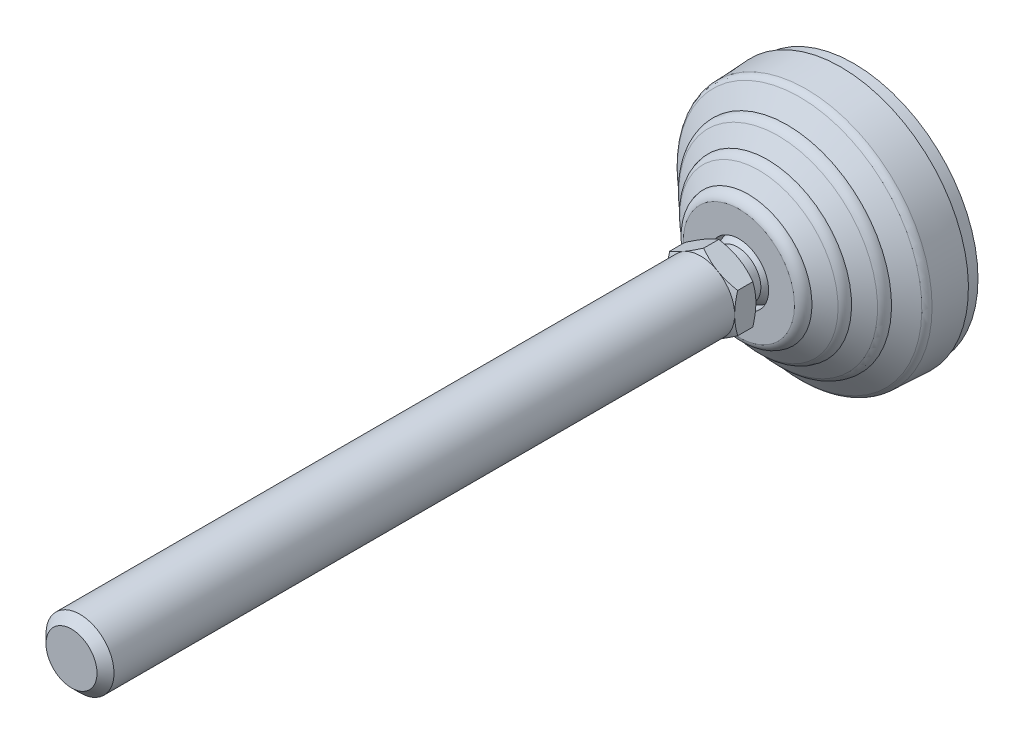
ISO-10303-21;
HEADER;
FILE_DESCRIPTION(('STEP AP214'),'2;1');
FILE_NAME('part.step','',(''),(''),'','','');
FILE_SCHEMA(('AUTOMOTIVE_DESIGN { 1 0 10303 214 1 1 1 1 }'));
ENDSEC;
DATA;
#1=APPLICATION_CONTEXT('core data for automotive mechanical design processes');
#2=APPLICATION_PROTOCOL_DEFINITION('international standard','automotive_design',2000,#1);
#3=PRODUCT_CONTEXT('',#1,'mechanical');
#4=PRODUCT('Part','Part','',(#3));
#5=PRODUCT_RELATED_PRODUCT_CATEGORY('part','',(#4));
#6=PRODUCT_DEFINITION_FORMATION('','',#4);
#7=PRODUCT_DEFINITION_CONTEXT('part definition',#1,'design');
#8=PRODUCT_DEFINITION('design','',#6,#7);
#9=PRODUCT_DEFINITION_SHAPE('','',#8);
#10=(LENGTH_UNIT() NAMED_UNIT(*) SI_UNIT(.MILLI.,.METRE.));
#11=(NAMED_UNIT(*) PLANE_ANGLE_UNIT() SI_UNIT($,.RADIAN.));
#12=(NAMED_UNIT(*) SI_UNIT($,.STERADIAN.) SOLID_ANGLE_UNIT());
#13=UNCERTAINTY_MEASURE_WITH_UNIT(LENGTH_MEASURE(1.E-05),#10,'distance_accuracy_value','');
#14=(GEOMETRIC_REPRESENTATION_CONTEXT(3) GLOBAL_UNCERTAINTY_ASSIGNED_CONTEXT((#13)) GLOBAL_UNIT_ASSIGNED_CONTEXT((#10,
#11,#12)) REPRESENTATION_CONTEXT('',''));
#15=CARTESIAN_POINT('',(0.,0.,0.));
#16=DIRECTION('',(0.,0.,1.));
#17=DIRECTION('',(1.,0.,0.));
#18=AXIS2_PLACEMENT_3D('',#15,#16,#17);
#19=CARTESIAN_POINT('',(0.,0.,35.2753734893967));
#20=DIRECTION('',(0.,0.,-1.));
#21=DIRECTION('',(0.,1.,0.));
#22=AXIS2_PLACEMENT_3D('',#19,#20,#21);
#23=CONICAL_SURFACE('',#22,9.2450899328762,1.0471975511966);
#24=CARTESIAN_POINT('',(0.,0.,36.));
#25=DIRECTION('',(0.,0.,-1.));
#26=DIRECTION('',(0.,1.,0.));
#27=AXIS2_PLACEMENT_3D('',#24,#25,#26);
#28=CIRCLE('',#27,7.99);
#29=CARTESIAN_POINT('',(0.,7.99,36.));
#30=VERTEX_POINT('',#29);
#31=EDGE_CURVE('E124',#30,#30,#28,.F.);
#32=ORIENTED_EDGE('',*,*,#31,.F.);
#33=EDGE_LOOP('',(#32));
#34=FACE_BOUND('',#33,.T.);
#35=CARTESIAN_POINT('',(-4.19327850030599E-08,-9.23760428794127,35.2796952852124));
#36=CARTESIAN_POINT('',(0.175847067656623,-9.13607893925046,35.3382996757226));
#37=CARTESIAN_POINT('',(0.352349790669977,-9.03417505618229,35.3942441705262));
#38=CARTESIAN_POINT('',(0.706788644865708,-8.82953969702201,35.5000807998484));
#39=CARTESIAN_POINT('',(0.884725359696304,-8.72680788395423,35.5499703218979));
#40=CARTESIAN_POINT('',(1.42138431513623,-8.41696768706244,35.6895770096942));
#41=CARTESIAN_POINT('',(1.78222493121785,-8.20863626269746,35.7689823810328));
#42=CARTESIAN_POINT('',(2.32221590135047,-7.896872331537,35.862092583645));
#43=CARTESIAN_POINT('',(2.49975318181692,-7.79437113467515,35.8886165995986));
#44=CARTESIAN_POINT('',(2.85563052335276,-7.58890525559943,35.9330919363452));
#45=CARTESIAN_POINT('',(3.03397051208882,-7.48594061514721,35.9510440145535));
#46=CARTESIAN_POINT('',(3.3909574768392,-7.27983409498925,35.9779205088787));
#47=CARTESIAN_POINT('',(3.56960387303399,-7.17669255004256,35.9868551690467));
#48=CARTESIAN_POINT('',(3.92706158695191,-6.97031424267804,35.9955052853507));
#49=CARTESIAN_POINT('',(4.10587289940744,-6.86707748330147,35.995221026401));
#50=CARTESIAN_POINT('',(4.44015430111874,-6.67408002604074,35.9860752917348));
#51=CARTESIAN_POINT('',(4.59564800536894,-6.58430569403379,35.9783294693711));
#52=CARTESIAN_POINT('',(4.90627121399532,-6.4049673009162,35.956016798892));
#53=CARTESIAN_POINT('',(5.06140069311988,-6.31540325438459,35.9414494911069));
#54=CARTESIAN_POINT('',(5.52618852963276,-6.04705787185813,35.8878596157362));
#55=CARTESIAN_POINT('',(5.83502420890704,-5.86875150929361,35.8389557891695));
#56=CARTESIAN_POINT('',(6.455971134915,-5.51024763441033,35.7166979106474));
#57=CARTESIAN_POINT('',(6.76800315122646,-5.33009586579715,35.6428257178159));
#58=CARTESIAN_POINT('',(7.38741452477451,-4.97247854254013,35.4751673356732));
#59=CARTESIAN_POINT('',(7.69480181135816,-4.79500840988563,35.3814205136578));
#60=CARTESIAN_POINT('',(7.9999999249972,-4.6188021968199,35.2796953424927));
#61=B_SPLINE_CURVE_WITH_KNOTS('',3,(#35,#36,#37,#38,#39,#40,#41,#42,#43,#44,#45,#46,#47,#48,#49,
#50,#51,#52,#53,#54,#55,#56,#57,#58,#59,#60),.UNSPECIFIED.,.F.,.F.,(4,2,2,2,2,2,2,2,2,2,2,2,4),
(0.,0.633965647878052,1.26820386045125,2.53931509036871,3.15930425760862,3.77923863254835,
4.39846794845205,5.01767812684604,5.55669080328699,6.09573980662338,7.17460542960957,
8.2773951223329,9.37802050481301),.UNSPECIFIED.);
#62=CARTESIAN_POINT('',(-1.44240226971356E-08,-9.23760431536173,35.2796953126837));
#63=VERTEX_POINT('',#62);
#64=CARTESIAN_POINT('',(8.,-4.61880217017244,35.2796953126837));
#65=VERTEX_POINT('',#64);
#66=EDGE_CURVE('E140',#63,#65,#61,.T.);
#67=ORIENTED_EDGE('',*,*,#66,.T.);
#68=CARTESIAN_POINT('',(7.9999999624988,-4.6188021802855,35.2796952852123));
#69=CARTESIAN_POINT('',(7.99999998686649,-4.23969380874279,35.3891659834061));
#70=CARTESIAN_POINT('',(7.999999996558,-3.85751175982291,35.4893813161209));
#71=CARTESIAN_POINT('',(8.00000000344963,-3.08693961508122,35.6664987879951));
#72=CARTESIAN_POINT('',(8.00000000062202,-2.69853763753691,35.7433487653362));
#73=CARTESIAN_POINT('',(7.99999999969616,-2.11699996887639,35.8364192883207));
#74=CARTESIAN_POINT('',(7.99999999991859,-1.92560834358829,35.8635449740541));
#75=CARTESIAN_POINT('',(8.0000000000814,-1.54193621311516,35.9104602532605));
#76=CARTESIAN_POINT('',(8.0000000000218,-1.34965578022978,35.9302504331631));
#77=CARTESIAN_POINT('',(7.99999999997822,-0.96464588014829,35.962068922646));
#78=CARTESIAN_POINT('',(7.99999999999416,-0.771917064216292,35.9741050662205));
#79=CARTESIAN_POINT('',(8.00000000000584,-0.386125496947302,35.9901838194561));
#80=CARTESIAN_POINT('',(8.00000000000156,-0.193062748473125,35.9942264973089));
#81=CARTESIAN_POINT('',(7.99999999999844,0.193062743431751,35.9942264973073));
#82=CARTESIAN_POINT('',(7.99999999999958,0.38612548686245,35.9901838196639));
#83=CARTESIAN_POINT('',(8.00000000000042,0.771917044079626,35.9741050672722));
#84=CARTESIAN_POINT('',(8.00000000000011,0.964645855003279,35.962068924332));
#85=CARTESIAN_POINT('',(7.99999999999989,1.34965574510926,35.930250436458));
#86=CARTESIAN_POINT('',(7.99999999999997,1.54193617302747,35.9104602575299));
#87=CARTESIAN_POINT('',(8.00000000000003,1.92560829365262,35.8635449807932));
#88=CARTESIAN_POINT('',(8.00000000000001,2.11699991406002,35.8364192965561));
#89=CARTESIAN_POINT('',(7.99999999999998,2.69853756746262,35.7433487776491));
#90=CARTESIAN_POINT('',(7.99999999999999,3.0869395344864,35.6664988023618));
#91=CARTESIAN_POINT('',(8.00000000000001,3.85751166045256,35.4893813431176));
#92=CARTESIAN_POINT('',(8.00000000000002,4.23969370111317,35.3891660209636));
#93=CARTESIAN_POINT('',(8.,4.61880206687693,35.2796953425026));
#94=B_SPLINE_CURVE_WITH_KNOTS('',3,(#68,#69,#70,#71,#72,#73,#74,#75,#76,#77,#78,#79,#80,#81,#82,
#83,#84,#85,#86,#87,#88,#89,#90,#91,#92,#93),.UNSPECIFIED.,.F.,.F.,(4,2,2,2,2,2,2,2,2,2,2,2,4),
(0.,1.1842935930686,2.37121196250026,2.95099639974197,3.53073447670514,4.10988591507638,
4.68903241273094,5.26817889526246,5.84733031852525,6.42706838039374,7.00685280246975,
8.19377114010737,9.37806470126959),.UNSPECIFIED.);
#95=CARTESIAN_POINT('',(8.00000001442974,4.618802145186,35.2796953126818));
#96=VERTEX_POINT('',#95);
#97=EDGE_CURVE('E132',#65,#96,#94,.T.);
#98=ORIENTED_EDGE('',*,*,#97,.T.);
#99=CARTESIAN_POINT('',(8.00000000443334,4.61880210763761,35.2796952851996));
#100=CARTESIAN_POINT('',(7.82415291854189,4.72032749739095,35.3382996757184));
#101=CARTESIAN_POINT('',(7.64765020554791,4.8222313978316,35.3942441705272));
#102=CARTESIAN_POINT('',(7.29321135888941,5.02686677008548,35.500080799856));
#103=CARTESIAN_POINT('',(7.11527464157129,5.12959857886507,35.549970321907));
#104=CARTESIAN_POINT('',(6.57861568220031,5.43943876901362,35.689577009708));
#105=CARTESIAN_POINT('',(6.21777506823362,5.6477701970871,35.7689823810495));
#106=CARTESIAN_POINT('',(5.67778409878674,5.95953412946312,35.8620925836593));
#107=CARTESIAN_POINT('',(5.50024681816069,6.06203532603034,35.8886165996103));
#108=CARTESIAN_POINT('',(5.14436947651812,6.2675012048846,35.9330919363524));
#109=CARTESIAN_POINT('',(4.96602948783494,6.37046584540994,35.9510440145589));
#110=CARTESIAN_POINT('',(4.60904252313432,6.57657236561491,35.977920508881));
#111=CARTESIAN_POINT('',(4.43039612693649,6.6797139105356,35.986855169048));
#112=CARTESIAN_POINT('',(4.0729384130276,6.88609221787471,35.9955052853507));
#113=CARTESIAN_POINT('',(3.89412710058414,6.98932897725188,35.9952210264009));
#114=CARTESIAN_POINT('',(3.55984569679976,7.18232643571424,35.9860752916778));
#115=CARTESIAN_POINT('',(3.40435199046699,7.27210076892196,35.9783294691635));
#116=CARTESIAN_POINT('',(3.09372877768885,7.45143916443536,35.956016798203));
#117=CARTESIAN_POINT('',(2.9385992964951,7.54100321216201,35.9414494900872));
#118=CARTESIAN_POINT('',(2.47381145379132,7.80934859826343,35.8878596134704));
#119=CARTESIAN_POINT('',(2.16497577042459,7.98765496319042,35.8389557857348));
#120=CARTESIAN_POINT('',(1.54402883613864,8.34615884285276,35.7166979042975));
#121=CARTESIAN_POINT('',(1.23199681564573,8.52631061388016,35.6428257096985));
#122=CARTESIAN_POINT('',(0.612585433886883,8.88392794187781,35.4751673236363));
#123=CARTESIAN_POINT('',(0.305198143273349,9.06139807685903,35.3814204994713));
#124=CARTESIAN_POINT('',(2.56600557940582E-08,9.23760429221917,35.2796953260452));
#125=B_SPLINE_CURVE_WITH_KNOTS('',3,(#99,#100,#101,#102,#103,#104,#105,#106,#107,#108,#109,#110,
#111,#112,#113,#114,#115,#116,#117,#118,#119,#120,#121,#122,#123,#124),.UNSPECIFIED.,.F.,.F.,(4,
2,2,2,2,2,2,2,2,2,2,2,4),(0.,0.63396564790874,1.26820386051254,2.53931509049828,
3.15930425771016,3.77923863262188,4.39846794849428,5.01767812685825,5.55669081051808,
6.0957398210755,7.17460545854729,8.27739516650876,9.37802056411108),.UNSPECIFIED.);
#126=CARTESIAN_POINT('',(-1.1538685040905E-08,9.23760430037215,35.279695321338));
#127=VERTEX_POINT('',#126);
#128=EDGE_CURVE('E176',#96,#127,#125,.T.);
#129=ORIENTED_EDGE('',*,*,#128,.T.);
#130=CARTESIAN_POINT('',(-1.65350869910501E-08,9.23760427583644,35.2796953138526));
#131=CARTESIAN_POINT('',(-0.175847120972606,9.13607891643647,35.3382996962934));
#132=CARTESIAN_POINT('',(-0.352349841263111,9.03417502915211,35.3942441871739));
#133=CARTESIAN_POINT('',(-0.7067886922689,8.82953966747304,35.5000808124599));
#134=CARTESIAN_POINT('',(-0.884725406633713,8.72680785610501,35.5499703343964));
#135=CARTESIAN_POINT('',(-1.42138436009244,8.41696766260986,35.6895770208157));
#136=CARTESIAN_POINT('',(-1.78222497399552,8.2086362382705,35.7689823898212));
#137=CARTESIAN_POINT('',(-2.32221594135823,7.89687230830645,35.8620925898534));
#138=CARTESIAN_POINT('',(-2.4997532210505,7.79437111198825,35.8886166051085));
#139=CARTESIAN_POINT('',(-2.85563056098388,7.58890523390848,35.9330919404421));
#140=CARTESIAN_POINT('',(-3.03397054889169,7.48594059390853,35.9510440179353));
#141=CARTESIAN_POINT('',(-3.39095751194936,7.27983407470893,35.9779205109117));
#142=CARTESIAN_POINT('',(-3.56960390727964,7.1766925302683,35.9868551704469));
#143=CARTESIAN_POINT('',(-3.92706161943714,6.97031422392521,35.9955052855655));
#144=CARTESIAN_POINT('',(-4.10587293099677,6.86707746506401,35.9952210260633));
#145=CARTESIAN_POINT('',(-4.44015433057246,6.67408000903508,35.9860752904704));
#146=CARTESIAN_POINT('',(-4.59564803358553,6.58430567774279,35.9783294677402));
#147=CARTESIAN_POINT('',(-4.90627123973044,6.40496728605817,35.956016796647));
#148=CARTESIAN_POINT('',(-5.06140071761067,6.31540324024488,35.9414494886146));
#149=CARTESIAN_POINT('',(-5.52618855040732,6.04705785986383,35.8878596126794));
#150=CARTESIAN_POINT('',(-5.83502422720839,5.8687514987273,35.8389557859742));
#151=CARTESIAN_POINT('',(-6.45597114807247,5.51024762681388,35.7166979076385));
#152=CARTESIAN_POINT('',(-6.76800316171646,5.33009585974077,35.6428257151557));
#153=CARTESIAN_POINT('',(-7.38741452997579,4.97247853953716,35.4751673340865));
#154=CARTESIAN_POINT('',(-7.69480181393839,4.7950084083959,35.381420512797));
#155=CARTESIAN_POINT('',(-7.9999999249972,4.6188021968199,35.2796953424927));
#156=B_SPLINE_CURVE_WITH_KNOTS('',3,(#130,#131,#132,#133,#134,#135,#136,#137,#138,#139,#140,
#141,#142,#143,#144,#145,#146,#147,#148,#149,#150,#151,#152,#153,#154,#155),.UNSPECIFIED.,.F.,
.F.,(4,2,2,2,2,2,2,2,2,2,2,2,4),(0.,0.633965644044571,1.26820385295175,2.53931507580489,
3.15930423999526,3.77923861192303,4.39846792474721,5.01767810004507,5.55669077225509,
6.09573977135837,7.17460538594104,8.27739506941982,9.37802044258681),.UNSPECIFIED.);
#157=CARTESIAN_POINT('',(-8.,4.61880217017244,35.2796953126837));
#158=VERTEX_POINT('',#157);
#159=EDGE_CURVE('E168',#127,#158,#156,.T.);
#160=ORIENTED_EDGE('',*,*,#159,.T.);
#161=CARTESIAN_POINT('',(-7.9999999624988,4.6188021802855,35.2796952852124));
#162=CARTESIAN_POINT('',(-7.99999998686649,4.23969380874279,35.3891659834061));
#163=CARTESIAN_POINT('',(-7.999999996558,3.8575117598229,35.4893813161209));
#164=CARTESIAN_POINT('',(-8.00000000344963,3.08693961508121,35.6664987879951));
#165=CARTESIAN_POINT('',(-8.00000000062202,2.69853763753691,35.7433487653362));
#166=CARTESIAN_POINT('',(-7.99999999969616,2.11699996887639,35.8364192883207));
#167=CARTESIAN_POINT('',(-7.99999999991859,1.92560834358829,35.8635449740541));
#168=CARTESIAN_POINT('',(-8.0000000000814,1.54193621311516,35.9104602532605));
#169=CARTESIAN_POINT('',(-8.0000000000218,1.34965578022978,35.9302504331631));
#170=CARTESIAN_POINT('',(-7.99999999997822,0.964645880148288,35.962068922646));
#171=CARTESIAN_POINT('',(-7.99999999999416,0.77191706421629,35.9741050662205));
#172=CARTESIAN_POINT('',(-8.00000000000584,0.386125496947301,35.9901838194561));
#173=CARTESIAN_POINT('',(-8.00000000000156,0.193062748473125,35.9942264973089));
#174=CARTESIAN_POINT('',(-7.99999999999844,-0.193062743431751,35.9942264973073));
#175=CARTESIAN_POINT('',(-7.99999999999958,-0.38612548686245,35.9901838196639));
#176=CARTESIAN_POINT('',(-8.00000000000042,-0.771917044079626,35.9741050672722));
#177=CARTESIAN_POINT('',(-8.00000000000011,-0.964645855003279,35.962068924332));
#178=CARTESIAN_POINT('',(-7.99999999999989,-1.34965574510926,35.930250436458));
#179=CARTESIAN_POINT('',(-7.99999999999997,-1.54193617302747,35.9104602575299));
#180=CARTESIAN_POINT('',(-8.00000000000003,-1.92560829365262,35.8635449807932));
#181=CARTESIAN_POINT('',(-8.00000000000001,-2.11699991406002,35.8364192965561));
#182=CARTESIAN_POINT('',(-7.99999999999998,-2.69853756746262,35.7433487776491));
#183=CARTESIAN_POINT('',(-7.99999999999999,-3.0869395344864,35.6664988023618));
#184=CARTESIAN_POINT('',(-8.00000000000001,-3.85751166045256,35.4893813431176));
#185=CARTESIAN_POINT('',(-8.00000000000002,-4.23969370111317,35.3891660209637));
#186=CARTESIAN_POINT('',(-8.,-4.61880206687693,35.2796953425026));
#187=B_SPLINE_CURVE_WITH_KNOTS('',3,(#161,#162,#163,#164,#165,#166,#167,#168,#169,#170,#171,
#172,#173,#174,#175,#176,#177,#178,#179,#180,#181,#182,#183,#184,#185,#186),.UNSPECIFIED.,.F.,
.F.,(4,2,2,2,2,2,2,2,2,2,2,2,4),(0.,1.1842935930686,2.37121196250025,2.95099639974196,
3.53073447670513,4.10988591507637,4.68903241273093,5.26817889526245,5.84733031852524,
6.42706838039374,7.00685280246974,8.19377114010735,9.37806470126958),.UNSPECIFIED.);
#188=CARTESIAN_POINT('',(-8.00000001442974,-4.61880214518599,35.2796953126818));
#189=VERTEX_POINT('',#188);
#190=EDGE_CURVE('E358',#158,#189,#187,.T.);
#191=ORIENTED_EDGE('',*,*,#190,.T.);
#192=CARTESIAN_POINT('',(-8.00000000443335,-4.61880210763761,35.2796952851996));
#193=CARTESIAN_POINT('',(-7.82415291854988,-4.72032749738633,35.3382996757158));
#194=CARTESIAN_POINT('',(-7.64765020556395,-4.82223139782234,35.3942441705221));
#195=CARTESIAN_POINT('',(-7.29321135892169,-5.02686677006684,35.5000807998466));
#196=CARTESIAN_POINT('',(-7.11527464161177,-5.1295985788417,35.5499703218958));
#197=CARTESIAN_POINT('',(-6.57861568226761,-5.43943876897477,35.6895770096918));
#198=CARTESIAN_POINT('',(-6.21777506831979,-5.64777019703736,35.7689823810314));
#199=CARTESIAN_POINT('',(-5.67778409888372,-5.95953412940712,35.8620925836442));
#200=CARTESIAN_POINT('',(-5.50024681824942,-6.06203532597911,35.8886165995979));
#201=CARTESIAN_POINT('',(-5.14436947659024,-6.26750120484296,35.9330919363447));
#202=CARTESIAN_POINT('',(-4.9660294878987,-6.37046584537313,35.9510440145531));
#203=CARTESIAN_POINT('',(-4.60904252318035,-6.57657236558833,35.9779205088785));
#204=CARTESIAN_POINT('',(-4.43039612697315,-6.67971391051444,35.9868551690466));
#205=CARTESIAN_POINT('',(-4.07293841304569,-6.88609221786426,35.9955052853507));
#206=CARTESIAN_POINT('',(-3.89412710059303,-6.98932897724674,35.995221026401));
#207=CARTESIAN_POINT('',(-3.55984569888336,-7.18232643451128,35.9860752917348));
#208=CARTESIAN_POINT('',(-3.40435199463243,-7.27210076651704,35.9783294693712));
#209=CARTESIAN_POINT('',(-3.09372878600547,-7.45143915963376,35.9560167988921));
#210=CARTESIAN_POINT('',(-2.93859930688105,-7.54100320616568,35.941449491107));
#211=CARTESIAN_POINT('',(-2.47381147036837,-7.80934858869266,35.8878596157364));
#212=CARTESIAN_POINT('',(-2.16497579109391,-7.98765495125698,35.8389557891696));
#213=CARTESIAN_POINT('',(-1.54402886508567,-8.34615882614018,35.7166979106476));
#214=CARTESIAN_POINT('',(-1.23199684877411,-8.52631059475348,35.642825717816));
#215=CARTESIAN_POINT('',(-0.612585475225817,-8.88392791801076,35.4751673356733));
#216=CARTESIAN_POINT('',(-0.305198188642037,-9.06139805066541,35.3814205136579));
#217=CARTESIAN_POINT('',(-7.50027841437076E-08,-9.23760426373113,35.2796953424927));
#218=B_SPLINE_CURVE_WITH_KNOTS('',3,(#192,#193,#194,#195,#196,#197,#198,#199,#200,#201,#202,
#203,#204,#205,#206,#207,#208,#209,#210,#211,#212,#213,#214,#215,#216,#217),.UNSPECIFIED.,.F.,
.F.,(4,2,2,2,2,2,2,2,2,2,2,2,4),(0.,0.633965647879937,1.26820386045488,2.53931509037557,
3.15930425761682,3.77923863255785,4.39846794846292,5.01767812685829,5.55669080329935,
6.09573980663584,7.17460542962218,8.27739512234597,9.37802050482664),.UNSPECIFIED.);
#219=EDGE_CURVE('E158',#189,#63,#218,.T.);
#220=ORIENTED_EDGE('',*,*,#219,.T.);
#221=EDGE_LOOP('',(#67,#98,#129,#160,#191,#220));
#222=FACE_BOUND('',#221,.T.);
#223=ADVANCED_FACE('F14',(#34,#222),#23,.T.);
#224=CARTESIAN_POINT('',(0.,-9.23760430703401,36.1));
#225=DIRECTION('',(0.5,0.866025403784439,0.));
#226=DIRECTION('',(-0.866025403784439,0.5,0.));
#227=AXIS2_PLACEMENT_3D('',#224,#225,#226);
#228=PLANE('',#227);
#229=DIRECTION('',(0.,0.,1.));
#230=VECTOR('',#229,1.);
#231=CARTESIAN_POINT('',(0.,-9.23760430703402,36.1));
#232=LINE('',#231,#230);
#233=CARTESIAN_POINT('',(0.,-9.23760430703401,31.7203046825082));
#234=VERTEX_POINT('',#233);
#235=EDGE_CURVE('E339',#234,#63,#232,.T.);
#236=ORIENTED_EDGE('',*,*,#235,.T.);
#237=ORIENTED_EDGE('',*,*,#219,.F.);
#238=DIRECTION('',(0.,0.,1.));
#239=VECTOR('',#238,1.);
#240=CARTESIAN_POINT('',(-8.,-4.61880215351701,36.1));
#241=LINE('',#240,#239);
#242=CARTESIAN_POINT('',(-8.,-4.61880215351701,31.7203046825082));
#243=VERTEX_POINT('',#242);
#244=EDGE_CURVE('E342',#243,#189,#241,.T.);
#245=ORIENTED_EDGE('',*,*,#244,.F.);
#246=CARTESIAN_POINT('',(0.,-9.23760430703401,31.7203046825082));
#247=CARTESIAN_POINT('',(-0.175847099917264,-9.13607893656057,31.6617003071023));
#248=CARTESIAN_POINT('',(-0.352349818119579,-9.03417504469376,31.6057558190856));
#249=CARTESIAN_POINT('',(-0.706788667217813,-8.82953967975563,31.4999191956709));
#250=CARTESIAN_POINT('',(-0.884725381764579,-8.72680786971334,31.4500296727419));
#251=CARTESIAN_POINT('',(-1.42138433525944,-8.41696767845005,31.3104229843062));
#252=CARTESIAN_POINT('',(-1.78222494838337,-8.20863625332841,31.2310176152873));
#253=CARTESIAN_POINT('',(-2.32221591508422,-7.8968723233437,31.1379074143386));
#254=CARTESIAN_POINT('',(-2.49975319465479,-7.79437112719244,31.1113833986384));
#255=CARTESIAN_POINT('',(-2.85563053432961,-7.5889052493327,31.0669080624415));
#256=CARTESIAN_POINT('',(-3.03397052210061,-7.48594060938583,31.0489559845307));
#257=CARTESIAN_POINT('',(-3.39095748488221,-7.27983409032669,31.0220794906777));
#258=CARTESIAN_POINT('',(-3.56960388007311,-7.17669254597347,31.0131448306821));
#259=CARTESIAN_POINT('',(-3.9270615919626,-6.97031423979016,31.0044947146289));
#260=CARTESIAN_POINT('',(-4.10587290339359,-6.86707748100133,31.0047789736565));
#261=CARTESIAN_POINT('',(-4.44015430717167,-6.67408002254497,31.0139247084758));
#262=CARTESIAN_POINT('',(-4.59564801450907,-6.58430568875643,31.0216705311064));
#263=CARTESIAN_POINT('',(-4.90627122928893,-6.40496729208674,31.0439832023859));
#264=CARTESIAN_POINT('',(-5.06140071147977,-6.3154032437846,31.0585505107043));
#265=CARTESIAN_POINT('',(-5.52618855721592,-6.04705785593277,31.1121403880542));
#266=CARTESIAN_POINT('',(-5.83502424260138,-5.86875148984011,31.161044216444));
#267=CARTESIAN_POINT('',(-6.4559711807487,-5.51024760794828,31.283302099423));
#268=CARTESIAN_POINT('',(-6.76800320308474,-5.33009583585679,31.3571742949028));
#269=CARTESIAN_POINT('',(-7.38741458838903,-4.97247850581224,31.5248326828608));
#270=CARTESIAN_POINT('',(-7.69480188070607,-4.79500836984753,31.6185795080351));
#271=CARTESIAN_POINT('',(-8.,-4.61880215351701,31.7203046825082));
#272=B_SPLINE_CURVE_WITH_KNOTS('',3,(#246,#247,#248,#249,#250,#251,#252,#253,#254,#255,#256,
#257,#258,#259,#260,#261,#262,#263,#264,#265,#266,#267,#268,#269,#270,#271),.UNSPECIFIED.,.F.,
.F.,(4,2,2,2,2,2,2,2,2,2,2,2,4),(0.,0.633965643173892,1.26820385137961,2.53931507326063,
3.15930423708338,3.77923860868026,4.39846792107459,5.01767809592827,5.55669078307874,
6.09573979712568,7.17460544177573,8.27739515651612,9.37802056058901),.UNSPECIFIED.);
#273=EDGE_CURVE('E341',#234,#243,#272,.T.);
#274=ORIENTED_EDGE('',*,*,#273,.F.);
#275=EDGE_LOOP('',(#236,#237,#245,#274));
#276=FACE_BOUND('',#275,.T.);
#277=ADVANCED_FACE('F152',(#276),#228,.F.);
#278=CARTESIAN_POINT('',(8.,-4.61880215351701,36.1));
#279=DIRECTION('',(-0.5,0.866025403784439,0.));
#280=DIRECTION('',(-0.866025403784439,-0.5,0.));
#281=AXIS2_PLACEMENT_3D('',#278,#279,#280);
#282=PLANE('',#281);
#283=DIRECTION('',(0.,0.,1.));
#284=VECTOR('',#283,1.);
#285=CARTESIAN_POINT('',(8.,-4.61880215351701,36.1));
#286=LINE('',#285,#284);
#287=CARTESIAN_POINT('',(8.,-4.61880215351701,31.7203046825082));
#288=VERTEX_POINT('',#287);
#289=EDGE_CURVE('E31',#288,#65,#286,.T.);
#290=ORIENTED_EDGE('',*,*,#289,.T.);
#291=ORIENTED_EDGE('',*,*,#66,.F.);
#292=ORIENTED_EDGE('',*,*,#235,.F.);
#293=CARTESIAN_POINT('',(8.,-4.61880215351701,31.7203046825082));
#294=CARTESIAN_POINT('',(7.82415290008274,-4.72032752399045,31.6617003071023));
#295=CARTESIAN_POINT('',(7.64765018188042,-4.82223141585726,31.6057558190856));
#296=CARTESIAN_POINT('',(7.29321133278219,-5.02686678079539,31.4999191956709));
#297=CARTESIAN_POINT('',(7.11527461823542,-5.12959859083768,31.4500296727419));
#298=CARTESIAN_POINT('',(6.57861566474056,-5.43943878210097,31.3104229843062));
#299=CARTESIAN_POINT('',(6.21777505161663,-5.64777020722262,31.2310176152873));
#300=CARTESIAN_POINT('',(5.67778408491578,-5.95953413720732,31.1379074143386));
#301=CARTESIAN_POINT('',(5.5002468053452,-6.06203533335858,31.1113833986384));
#302=CARTESIAN_POINT('',(5.14436946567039,-6.26750121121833,31.0669080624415));
#303=CARTESIAN_POINT('',(4.96602947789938,-6.37046585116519,31.0489559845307));
#304=CARTESIAN_POINT('',(4.60904251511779,-6.57657237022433,31.0220794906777));
#305=CARTESIAN_POINT('',(4.43039611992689,-6.67971391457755,31.0131448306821));
#306=CARTESIAN_POINT('',(4.0729384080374,-6.88609222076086,31.0044947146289));
#307=CARTESIAN_POINT('',(3.8941270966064,-6.98932897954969,31.0047789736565));
#308=CARTESIAN_POINT('',(3.55984569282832,-7.18232643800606,31.0139247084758));
#309=CARTESIAN_POINT('',(3.40435198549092,-7.27210077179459,31.0216705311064));
#310=CARTESIAN_POINT('',(3.09372877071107,-7.45143916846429,31.0439832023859));
#311=CARTESIAN_POINT('',(2.93859928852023,-7.54100321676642,31.0585505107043));
#312=CARTESIAN_POINT('',(2.47381144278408,-7.80934860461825,31.1121403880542));
#313=CARTESIAN_POINT('',(2.16497575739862,-7.98765497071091,31.161044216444));
#314=CARTESIAN_POINT('',(1.5440288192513,-8.34615885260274,31.283302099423));
#315=CARTESIAN_POINT('',(1.23199679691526,-8.52631062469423,31.3571742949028));
#316=CARTESIAN_POINT('',(0.612585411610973,-8.88392795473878,31.5248326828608));
#317=CARTESIAN_POINT('',(0.305198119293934,-9.0613980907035,31.6185795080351));
#318=CARTESIAN_POINT('',(0.,-9.23760430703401,31.7203046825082));
#319=B_SPLINE_CURVE_WITH_KNOTS('',3,(#293,#294,#295,#296,#297,#298,#299,#300,#301,#302,#303,
#304,#305,#306,#307,#308,#309,#310,#311,#312,#313,#314,#315,#316,#317,#318),.UNSPECIFIED.,.F.,
.F.,(4,2,2,2,2,2,2,2,2,2,2,2,4),(0.,0.633965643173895,1.26820385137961,2.53931507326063,
3.15930423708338,3.77923860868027,4.3984679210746,5.01767809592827,5.55669078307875,
6.09573979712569,7.17460544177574,8.27739515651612,9.37802056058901),.UNSPECIFIED.);
#320=EDGE_CURVE('E338',#288,#234,#319,.T.);
#321=ORIENTED_EDGE('',*,*,#320,.F.);
#322=EDGE_LOOP('',(#290,#291,#292,#321));
#323=FACE_BOUND('',#322,.T.);
#324=ADVANCED_FACE('F365',(#323),#282,.F.);
#325=CARTESIAN_POINT('',(-8.,4.61880215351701,36.1));
#326=DIRECTION('',(0.5,-0.866025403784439,0.));
#327=DIRECTION('',(0.866025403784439,0.5,0.));
#328=AXIS2_PLACEMENT_3D('',#325,#326,#327);
#329=PLANE('',#328);
#330=DIRECTION('',(0.,0.,1.));
#331=VECTOR('',#330,1.);
#332=CARTESIAN_POINT('',(-8.,4.61880215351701,36.1));
#333=LINE('',#332,#331);
#334=CARTESIAN_POINT('',(-8.,4.61880215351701,31.7203046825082));
#335=VERTEX_POINT('',#334);
#336=EDGE_CURVE('E345',#335,#158,#333,.T.);
#337=ORIENTED_EDGE('',*,*,#336,.T.);
#338=ORIENTED_EDGE('',*,*,#159,.F.);
#339=DIRECTION('',(0.,0.,1.));
#340=VECTOR('',#339,1.);
#341=CARTESIAN_POINT('',(0.,9.23760430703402,36.1));
#342=LINE('',#341,#340);
#343=CARTESIAN_POINT('',(0.,9.23760430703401,31.7203046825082));
#344=VERTEX_POINT('',#343);
#345=EDGE_CURVE('E207',#344,#127,#342,.T.);
#346=ORIENTED_EDGE('',*,*,#345,.F.);
#347=CARTESIAN_POINT('',(-8.,4.61880215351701,31.7203046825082));
#348=CARTESIAN_POINT('',(-7.82415290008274,4.72032752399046,31.6617003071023));
#349=CARTESIAN_POINT('',(-7.64765018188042,4.82223141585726,31.6057558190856));
#350=CARTESIAN_POINT('',(-7.29321133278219,5.02686678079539,31.4999191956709));
#351=CARTESIAN_POINT('',(-7.11527461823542,5.12959859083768,31.4500296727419));
#352=CARTESIAN_POINT('',(-6.57861566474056,5.43943878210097,31.3104229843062));
#353=CARTESIAN_POINT('',(-6.21777505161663,5.64777020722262,31.2310176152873));
#354=CARTESIAN_POINT('',(-5.67778408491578,5.95953413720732,31.1379074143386));
#355=CARTESIAN_POINT('',(-5.50024680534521,6.06203533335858,31.1113833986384));
#356=CARTESIAN_POINT('',(-5.14436946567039,6.26750121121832,31.0669080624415));
#357=CARTESIAN_POINT('',(-4.96602947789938,6.37046585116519,31.0489559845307));
#358=CARTESIAN_POINT('',(-4.60904251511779,6.57657237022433,31.0220794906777));
#359=CARTESIAN_POINT('',(-4.43039611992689,6.67971391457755,31.0131448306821));
#360=CARTESIAN_POINT('',(-4.07293840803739,6.88609222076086,31.0044947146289));
#361=CARTESIAN_POINT('',(-3.8941270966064,6.98932897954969,31.0047789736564));
#362=CARTESIAN_POINT('',(-3.55984569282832,7.18232643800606,31.0139247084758));
#363=CARTESIAN_POINT('',(-3.40435198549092,7.27210077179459,31.0216705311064));
#364=CARTESIAN_POINT('',(-3.09372877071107,7.45143916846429,31.0439832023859));
#365=CARTESIAN_POINT('',(-2.93859928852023,7.54100321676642,31.0585505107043));
#366=CARTESIAN_POINT('',(-2.47381144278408,7.80934860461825,31.1121403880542));
#367=CARTESIAN_POINT('',(-2.16497575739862,7.98765497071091,31.161044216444));
#368=CARTESIAN_POINT('',(-1.5440288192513,8.34615885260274,31.2833020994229));
#369=CARTESIAN_POINT('',(-1.23199679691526,8.52631062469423,31.3571742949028));
#370=CARTESIAN_POINT('',(-0.612585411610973,8.88392795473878,31.5248326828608));
#371=CARTESIAN_POINT('',(-0.305198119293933,9.06139809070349,31.6185795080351));
#372=CARTESIAN_POINT('',(0.,9.23760430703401,31.7203046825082));
#373=B_SPLINE_CURVE_WITH_KNOTS('',3,(#347,#348,#349,#350,#351,#352,#353,#354,#355,#356,#357,
#358,#359,#360,#361,#362,#363,#364,#365,#366,#367,#368,#369,#370,#371,#372),.UNSPECIFIED.,.F.,
.F.,(4,2,2,2,2,2,2,2,2,2,2,2,4),(0.,0.633965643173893,1.26820385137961,2.53931507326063,
3.15930423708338,3.77923860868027,4.3984679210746,5.01767809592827,5.55669078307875,
6.09573979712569,7.17460544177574,8.27739515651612,9.37802056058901),.UNSPECIFIED.);
#374=EDGE_CURVE('E209',#335,#344,#373,.T.);
#375=ORIENTED_EDGE('',*,*,#374,.F.);
#376=EDGE_LOOP('',(#337,#338,#346,#375));
#377=FACE_BOUND('',#376,.T.);
#378=ADVANCED_FACE('F195',(#377),#329,.F.);
#379=CARTESIAN_POINT('',(-8.,-4.61880215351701,36.1));
#380=DIRECTION('',(1.,0.,0.));
#381=DIRECTION('',(0.,1.,0.));
#382=AXIS2_PLACEMENT_3D('',#379,#380,#381);
#383=PLANE('',#382);
#384=ORIENTED_EDGE('',*,*,#244,.T.);
#385=ORIENTED_EDGE('',*,*,#190,.F.);
#386=ORIENTED_EDGE('',*,*,#336,.F.);
#387=CARTESIAN_POINT('',(-8.,-4.618802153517,31.7203046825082));
#388=CARTESIAN_POINT('',(-8.,-4.23969378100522,31.610834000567));
#389=CARTESIAN_POINT('',(-8.,-3.85751173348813,31.5106186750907));
#390=CARTESIAN_POINT('',(-8.,-3.08693959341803,31.3335012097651));
#391=CARTESIAN_POINT('',(-8.,-2.69853761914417,31.2566512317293));
#392=CARTESIAN_POINT('',(-8.,-2.11699995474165,31.163580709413));
#393=CARTESIAN_POINT('',(-8.,-1.92560833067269,31.1364550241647));
#394=CARTESIAN_POINT('',(-8.,-1.54193620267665,31.089539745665));
#395=CARTESIAN_POINT('',(-8.,-1.3496557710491,31.069749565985));
#396=CARTESIAN_POINT('',(-8.,-0.964645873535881,31.0379310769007));
#397=CARTESIAN_POINT('',(-8.,-0.771917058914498,31.0258949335));
#398=CARTESIAN_POINT('',(-8.,-0.386125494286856,31.0098161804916));
#399=CARTESIAN_POINT('',(-8.,-0.193062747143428,31.0057735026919));
#400=CARTESIAN_POINT('',(-8.,0.193062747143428,31.0057735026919));
#401=CARTESIAN_POINT('',(-8.,0.386125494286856,31.0098161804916));
#402=CARTESIAN_POINT('',(-8.,0.771917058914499,31.0258949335));
#403=CARTESIAN_POINT('',(-8.,0.964645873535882,31.0379310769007));
#404=CARTESIAN_POINT('',(-8.,1.3496557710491,31.069749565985));
#405=CARTESIAN_POINT('',(-8.,1.54193620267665,31.089539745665));
#406=CARTESIAN_POINT('',(-8.,1.9256083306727,31.1364550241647));
#407=CARTESIAN_POINT('',(-8.,2.11699995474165,31.163580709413));
#408=CARTESIAN_POINT('',(-8.,2.69853761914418,31.2566512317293));
#409=CARTESIAN_POINT('',(-8.,3.08693959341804,31.3335012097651));
#410=CARTESIAN_POINT('',(-8.,3.85751173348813,31.5106186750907));
#411=CARTESIAN_POINT('',(-8.,4.23969378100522,31.610834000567));
#412=CARTESIAN_POINT('',(-8.,4.61880215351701,31.7203046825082));
#413=B_SPLINE_CURVE_WITH_KNOTS('',3,(#387,#388,#389,#390,#391,#392,#393,#394,#395,#396,#397,
#398,#399,#400,#401,#402,#403,#404,#405,#406,#407,#408,#409,#410,#411,#412),.UNSPECIFIED.,.F.,
.F.,(4,2,2,2,2,2,2,2,2,2,2,2,4),(0.,1.18429358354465,2.37121194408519,2.95099637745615,
3.53073445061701,4.10988588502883,4.68903237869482,5.26817887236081,5.84733030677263,
6.42706837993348,7.00685281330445,8.19377117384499,9.37806475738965),.UNSPECIFIED.);
#414=EDGE_CURVE('E344',#243,#335,#413,.T.);
#415=ORIENTED_EDGE('',*,*,#414,.F.);
#416=EDGE_LOOP('',(#384,#385,#386,#415));
#417=FACE_BOUND('',#416,.T.);
#418=ADVANCED_FACE('F381',(#417),#383,.F.);
#419=CARTESIAN_POINT('',(8.,4.61880215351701,36.1));
#420=DIRECTION('',(-1.,0.,0.));
#421=DIRECTION('',(0.,-1.,0.));
#422=AXIS2_PLACEMENT_3D('',#419,#420,#421);
#423=PLANE('',#422);
#424=DIRECTION('',(0.,0.,1.));
#425=VECTOR('',#424,1.);
#426=CARTESIAN_POINT('',(8.,4.61880215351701,36.1));
#427=LINE('',#426,#425);
#428=CARTESIAN_POINT('',(8.,4.61880215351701,31.7203046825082));
#429=VERTEX_POINT('',#428);
#430=EDGE_CURVE('E335',#96,#429,#427,.F.);
#431=ORIENTED_EDGE('',*,*,#430,.F.);
#432=ORIENTED_EDGE('',*,*,#97,.F.);
#433=ORIENTED_EDGE('',*,*,#289,.F.);
#434=CARTESIAN_POINT('',(8.,4.618802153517,31.7203046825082));
#435=CARTESIAN_POINT('',(8.,4.23969378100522,31.610834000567));
#436=CARTESIAN_POINT('',(8.,3.85751173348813,31.5106186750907));
#437=CARTESIAN_POINT('',(8.,3.08693959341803,31.3335012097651));
#438=CARTESIAN_POINT('',(8.,2.69853761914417,31.2566512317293));
#439=CARTESIAN_POINT('',(8.,2.11699995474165,31.163580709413));
#440=CARTESIAN_POINT('',(8.,1.92560833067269,31.1364550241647));
#441=CARTESIAN_POINT('',(8.,1.54193620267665,31.089539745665));
#442=CARTESIAN_POINT('',(8.,1.3496557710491,31.069749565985));
#443=CARTESIAN_POINT('',(8.,0.964645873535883,31.0379310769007));
#444=CARTESIAN_POINT('',(8.,0.7719170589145,31.0258949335));
#445=CARTESIAN_POINT('',(8.,0.386125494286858,31.0098161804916));
#446=CARTESIAN_POINT('',(8.,0.19306274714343,31.0057735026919));
#447=CARTESIAN_POINT('',(8.,-0.193062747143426,31.0057735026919));
#448=CARTESIAN_POINT('',(8.,-0.386125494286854,31.0098161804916));
#449=CARTESIAN_POINT('',(8.,-0.771917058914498,31.0258949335));
#450=CARTESIAN_POINT('',(8.,-0.96464587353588,31.0379310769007));
#451=CARTESIAN_POINT('',(8.,-1.3496557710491,31.069749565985));
#452=CARTESIAN_POINT('',(8.,-1.54193620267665,31.089539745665));
#453=CARTESIAN_POINT('',(8.,-1.9256083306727,31.1364550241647));
#454=CARTESIAN_POINT('',(8.,-2.11699995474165,31.163580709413));
#455=CARTESIAN_POINT('',(8.,-2.69853761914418,31.2566512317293));
#456=CARTESIAN_POINT('',(8.,-3.08693959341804,31.3335012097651));
#457=CARTESIAN_POINT('',(8.,-3.85751173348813,31.5106186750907));
#458=CARTESIAN_POINT('',(8.,-4.23969378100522,31.610834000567));
#459=CARTESIAN_POINT('',(8.,-4.61880215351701,31.7203046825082));
#460=B_SPLINE_CURVE_WITH_KNOTS('',3,(#434,#435,#436,#437,#438,#439,#440,#441,#442,#443,#444,
#445,#446,#447,#448,#449,#450,#451,#452,#453,#454,#455,#456,#457,#458,#459),.UNSPECIFIED.,.F.,
.F.,(4,2,2,2,2,2,2,2,2,2,2,2,4),(0.,1.18429358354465,2.37121194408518,2.95099637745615,
3.53073445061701,4.10988588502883,4.68903237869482,5.26817887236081,5.84733030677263,
6.42706837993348,7.00685281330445,8.193771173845,9.37806475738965),.UNSPECIFIED.);
#461=EDGE_CURVE('E184',#429,#288,#460,.T.);
#462=ORIENTED_EDGE('',*,*,#461,.F.);
#463=EDGE_LOOP('',(#431,#432,#433,#462));
#464=FACE_BOUND('',#463,.T.);
#465=ADVANCED_FACE('F147',(#464),#423,.F.);
#466=CARTESIAN_POINT('',(0.,9.23760430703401,36.1));
#467=DIRECTION('',(-0.5,-0.866025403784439,0.));
#468=DIRECTION('',(0.866025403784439,-0.5,0.));
#469=AXIS2_PLACEMENT_3D('',#466,#467,#468);
#470=PLANE('',#469);
#471=ORIENTED_EDGE('',*,*,#345,.T.);
#472=ORIENTED_EDGE('',*,*,#128,.F.);
#473=ORIENTED_EDGE('',*,*,#430,.T.);
#474=CARTESIAN_POINT('',(0.,9.23760430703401,31.7203046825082));
#475=CARTESIAN_POINT('',(0.175847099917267,9.13607893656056,31.6617003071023));
#476=CARTESIAN_POINT('',(0.352349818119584,9.03417504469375,31.6057558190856));
#477=CARTESIAN_POINT('',(0.706788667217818,8.82953967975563,31.4999191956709));
#478=CARTESIAN_POINT('',(0.884725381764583,8.72680786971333,31.4500296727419));
#479=CARTESIAN_POINT('',(1.42138433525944,8.41696767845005,31.3104229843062));
#480=CARTESIAN_POINT('',(1.78222494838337,8.20863625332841,31.2310176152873));
#481=CARTESIAN_POINT('',(2.32221591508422,7.8968723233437,31.1379074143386));
#482=CARTESIAN_POINT('',(2.4997531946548,7.79437112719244,31.1113833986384));
#483=CARTESIAN_POINT('',(2.85563053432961,7.5889052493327,31.0669080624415));
#484=CARTESIAN_POINT('',(3.03397052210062,7.48594060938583,31.0489559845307));
#485=CARTESIAN_POINT('',(3.39095748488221,7.27983409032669,31.0220794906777));
#486=CARTESIAN_POINT('',(3.56960388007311,7.17669254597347,31.0131448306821));
#487=CARTESIAN_POINT('',(3.92706159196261,6.97031423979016,31.0044947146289));
#488=CARTESIAN_POINT('',(4.1058729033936,6.86707748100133,31.0047789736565));
#489=CARTESIAN_POINT('',(4.44015430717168,6.67408002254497,31.0139247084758));
#490=CARTESIAN_POINT('',(4.59564801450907,6.58430568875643,31.0216705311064));
#491=CARTESIAN_POINT('',(4.90627122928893,6.40496729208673,31.0439832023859));
#492=CARTESIAN_POINT('',(5.06140071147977,6.3154032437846,31.0585505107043));
#493=CARTESIAN_POINT('',(5.52618855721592,6.04705785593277,31.1121403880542));
#494=CARTESIAN_POINT('',(5.83502424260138,5.86875148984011,31.161044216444));
#495=CARTESIAN_POINT('',(6.4559711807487,5.51024760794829,31.2833020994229));
#496=CARTESIAN_POINT('',(6.76800320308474,5.33009583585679,31.3571742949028));
#497=CARTESIAN_POINT('',(7.38741458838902,4.97247850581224,31.5248326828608));
#498=CARTESIAN_POINT('',(7.69480188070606,4.79500836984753,31.6185795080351));
#499=CARTESIAN_POINT('',(8.,4.61880215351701,31.7203046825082));
#500=B_SPLINE_CURVE_WITH_KNOTS('',3,(#474,#475,#476,#477,#478,#479,#480,#481,#482,#483,#484,
#485,#486,#487,#488,#489,#490,#491,#492,#493,#494,#495,#496,#497,#498,#499),.UNSPECIFIED.,.F.,
.F.,(4,2,2,2,2,2,2,2,2,2,2,2,4),(0.,0.633965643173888,1.2682038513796,2.53931507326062,
3.15930423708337,3.77923860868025,4.39846792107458,5.01767809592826,5.55669078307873,
6.09573979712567,7.17460544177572,8.2773951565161,9.37802056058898),.UNSPECIFIED.);
#501=EDGE_CURVE('E68',#344,#429,#500,.T.);
#502=ORIENTED_EDGE('',*,*,#501,.F.);
#503=EDGE_LOOP('',(#471,#472,#473,#502));
#504=FACE_BOUND('',#503,.T.);
#505=ADVANCED_FACE('F191',(#504),#470,.F.);
#506=CARTESIAN_POINT('',(0.,0.,31.7246265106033));
#507=DIRECTION('',(0.,0.,1.));
#508=DIRECTION('',(0.,-1.,0.));
#509=AXIS2_PLACEMENT_3D('',#506,#507,#508);
#510=CONICAL_SURFACE('',#509,9.24508993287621,1.0471975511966);
#511=CARTESIAN_POINT('',(0.,0.,31.));
#512=DIRECTION('',(0.,0.,1.));
#513=DIRECTION('',(0.,-1.,0.));
#514=AXIS2_PLACEMENT_3D('',#511,#512,#513);
#515=CIRCLE('',#514,7.99);
#516=CARTESIAN_POINT('',(0.,-7.99,31.));
#517=VERTEX_POINT('',#516);
#518=EDGE_CURVE('E208',#517,#517,#515,.T.);
#519=ORIENTED_EDGE('',*,*,#518,.T.);
#520=EDGE_LOOP('',(#519));
#521=FACE_BOUND('',#520,.T.);
#522=ORIENTED_EDGE('',*,*,#501,.T.);
#523=ORIENTED_EDGE('',*,*,#461,.T.);
#524=ORIENTED_EDGE('',*,*,#320,.T.);
#525=ORIENTED_EDGE('',*,*,#273,.T.);
#526=ORIENTED_EDGE('',*,*,#414,.T.);
#527=ORIENTED_EDGE('',*,*,#374,.T.);
#528=EDGE_LOOP('',(#522,#523,#524,#525,#526,#527));
#529=FACE_BOUND('',#528,.T.);
#530=ADVANCED_FACE('F194',(#521,#529),#510,.T.);
#531=CARTESIAN_POINT('',(6.745,0.,31.));
#532=DIRECTION('',(0.,0.,-1.));
#533=DIRECTION('',(1.,0.,0.));
#534=AXIS2_PLACEMENT_3D('',#531,#532,#533);
#535=PLANE('',#534);
#536=CARTESIAN_POINT('',(0.,0.,31.));
#537=DIRECTION('',(0.,0.,-1.));
#538=DIRECTION('',(0.,1.,0.));
#539=AXIS2_PLACEMENT_3D('',#536,#537,#538);
#540=CIRCLE('',#539,5.5);
#541=CARTESIAN_POINT('',(0.,5.5,31.));
#542=VERTEX_POINT('',#541);
#543=EDGE_CURVE('E217',#542,#542,#540,.F.);
#544=ORIENTED_EDGE('',*,*,#543,.T.);
#545=EDGE_LOOP('',(#544));
#546=FACE_BOUND('',#545,.T.);
#547=ORIENTED_EDGE('',*,*,#518,.F.);
#548=EDGE_LOOP('',(#547));
#549=FACE_BOUND('',#548,.T.);
#550=ADVANCED_FACE('F563',(#546,#549),#535,.T.);
#551=CARTESIAN_POINT('',(0.,0.,29.1650635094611));
#552=DIRECTION('',(0.,0.,-1.));
#553=DIRECTION('',(0.,1.,0.));
#554=AXIS2_PLACEMENT_3D('',#551,#552,#553);
#555=CYLINDRICAL_SURFACE('',#554,5.5);
#556=ORIENTED_EDGE('',*,*,#543,.F.);
#557=EDGE_LOOP('',(#556));
#558=FACE_BOUND('',#557,.T.);
#559=CARTESIAN_POINT('',(0.,0.,27.3301270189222));
#560=DIRECTION('',(0.,0.,-1.));
#561=DIRECTION('',(0.,1.,0.));
#562=AXIS2_PLACEMENT_3D('',#559,#560,#561);
#563=CIRCLE('',#562,5.5);
#564=CARTESIAN_POINT('',(0.,5.5,27.3301270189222));
#565=VERTEX_POINT('',#564);
#566=EDGE_CURVE('E97',#565,#565,#563,.F.);
#567=ORIENTED_EDGE('',*,*,#566,.T.);
#568=EDGE_LOOP('',(#567));
#569=FACE_BOUND('',#568,.T.);
#570=ADVANCED_FACE('F117',(#558,#569),#555,.T.);
#571=CARTESIAN_POINT('',(0.,0.,23.));
#572=DIRECTION('',(1.,0.,0.));
#573=DIRECTION('',(0.,0.,1.));
#574=AXIS2_PLACEMENT_3D('',#571,#572,#573);
#575=SPHERICAL_SURFACE('',#574,7.);
#576=CARTESIAN_POINT('',(0.,0.,23.));
#577=DIRECTION('',(0.,0.,1.));
#578=DIRECTION('',(1.,0.,0.));
#579=AXIS2_PLACEMENT_3D('',#576,#577,#578);
#580=CIRCLE('',#579,7.);
#581=CARTESIAN_POINT('',(0.,7.,22.9999999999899));
#582=VERTEX_POINT('',#581);
#583=CARTESIAN_POINT('',(-7.,0.,23.));
#584=VERTEX_POINT('',#583);
#585=EDGE_CURVE('E77',#582,#584,#580,.T.);
#586=ORIENTED_EDGE('',*,*,#585,.T.);
#587=CARTESIAN_POINT('',(-7.,0.,23.));
#588=CARTESIAN_POINT('',(-7.00000242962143,-0.114537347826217,23.));
#589=CARTESIAN_POINT('',(-6.99718891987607,-0.229074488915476,23.));
#590=CARTESIAN_POINT('',(-6.98594746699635,-0.45787295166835,23.));
#591=CARTESIAN_POINT('',(-6.97751952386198,-0.572134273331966,23.));
#592=CARTESIAN_POINT('',(-6.95506664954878,-0.800105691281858,23.));
#593=CARTESIAN_POINT('',(-6.94104171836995,-0.913815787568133,23.));
#594=CARTESIAN_POINT('',(-6.90742942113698,-1.14041085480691,23.));
#595=CARTESIAN_POINT('',(-6.88784205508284,-1.25329582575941,23.));
#596=CARTESIAN_POINT('',(-6.84315187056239,-1.47796868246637,23.));
#597=CARTESIAN_POINT('',(-6.81804905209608,-1.58975656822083,23.));
#598=CARTESIAN_POINT('',(-6.76238849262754,-1.81196595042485,23.));
#599=CARTESIAN_POINT('',(-6.73183075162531,-1.9223874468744,23.));
#600=CARTESIAN_POINT('',(-6.66533394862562,-2.14159803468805,23.));
#601=CARTESIAN_POINT('',(-6.62939488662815,-2.25038712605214,23.));
#602=CARTESIAN_POINT('',(-6.55222202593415,-2.46607082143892,23.));
#603=CARTESIAN_POINT('',(-6.51098822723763,-2.5729654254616,23.));
#604=CARTESIAN_POINT('',(-6.42332522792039,-2.78460262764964,23.));
#605=CARTESIAN_POINT('',(-6.37689602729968,-2.88934522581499,23.));
#606=CARTESIAN_POINT('',(-6.27895407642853,-3.09642608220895,23.));
#607=CARTESIAN_POINT('',(-6.22744132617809,-3.19876434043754,23.));
#608=CARTESIAN_POINT('',(-6.11945637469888,-3.40078997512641,23.));
#609=CARTESIAN_POINT('',(-6.06298417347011,-3.50047735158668,23.));
#610=CARTESIAN_POINT('',(-5.94521636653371,-3.69696106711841,23.));
#611=CARTESIAN_POINT('',(-5.88392076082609,-3.79375740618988,23.));
#612=CARTESIAN_POINT('',(-5.75665381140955,-3.98422585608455,23.));
#613=CARTESIAN_POINT('',(-5.69068246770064,-4.07789796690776,23.));
#614=CARTESIAN_POINT('',(-5.55422297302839,-4.26189229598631,23.));
#615=CARTESIAN_POINT('',(-5.48373482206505,-4.35221451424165,23.));
#616=CARTESIAN_POINT('',(-5.33841152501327,-4.52929146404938,23.));
#617=CARTESIAN_POINT('',(-5.26357637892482,-4.61604619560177,23.));
#618=CARTESIAN_POINT('',(-5.10973937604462,-4.78577917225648,23.));
#619=CARTESIAN_POINT('',(-5.03073751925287,-4.8687574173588,23.));
#620=CARTESIAN_POINT('',(-4.8687574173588,-5.03073751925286,23.));
#621=CARTESIAN_POINT('',(-4.78577917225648,-5.10973937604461,23.));
#622=CARTESIAN_POINT('',(-4.61604619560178,-5.26357637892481,23.));
#623=CARTESIAN_POINT('',(-4.52929146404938,-5.33841152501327,23.));
#624=CARTESIAN_POINT('',(-4.35221451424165,-5.48373482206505,23.));
#625=CARTESIAN_POINT('',(-4.26189229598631,-5.55422297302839,23.));
#626=CARTESIAN_POINT('',(-4.07789796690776,-5.69068246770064,23.));
#627=CARTESIAN_POINT('',(-3.98422585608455,-5.75665381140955,23.));
#628=CARTESIAN_POINT('',(-3.79375740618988,-5.88392076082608,23.));
#629=CARTESIAN_POINT('',(-3.69696106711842,-5.9452163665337,23.));
#630=CARTESIAN_POINT('',(-3.50047735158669,-6.0629841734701,23.));
#631=CARTESIAN_POINT('',(-3.40078997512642,-6.11945637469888,23.));
#632=CARTESIAN_POINT('',(-3.19876434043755,-6.22744132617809,23.));
#633=CARTESIAN_POINT('',(-3.09642608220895,-6.27895407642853,23.));
#634=CARTESIAN_POINT('',(-2.88934522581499,-6.37689602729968,23.));
#635=CARTESIAN_POINT('',(-2.78460262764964,-6.42332522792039,23.));
#636=CARTESIAN_POINT('',(-2.57296542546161,-6.51098822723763,23.));
#637=CARTESIAN_POINT('',(-2.46607082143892,-6.55222202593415,23.));
#638=CARTESIAN_POINT('',(-2.25038712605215,-6.62939488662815,23.));
#639=CARTESIAN_POINT('',(-2.14159803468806,-6.66533394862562,23.));
#640=CARTESIAN_POINT('',(-1.92238744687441,-6.73183075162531,23.));
#641=CARTESIAN_POINT('',(-1.81196595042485,-6.76238849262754,23.));
#642=CARTESIAN_POINT('',(-1.58975656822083,-6.81804905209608,23.));
#643=CARTESIAN_POINT('',(-1.47796868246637,-6.84315187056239,23.));
#644=CARTESIAN_POINT('',(-1.25329582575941,-6.88784205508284,23.));
#645=CARTESIAN_POINT('',(-1.14041085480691,-6.90742942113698,23.));
#646=CARTESIAN_POINT('',(-0.913815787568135,-6.94104171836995,23.));
#647=CARTESIAN_POINT('',(-0.80010569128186,-6.95506664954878,23.));
#648=CARTESIAN_POINT('',(-0.572134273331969,-6.97751952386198,23.));
#649=CARTESIAN_POINT('',(-0.457872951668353,-6.98594746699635,23.));
#650=CARTESIAN_POINT('',(-0.229074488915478,-6.99718891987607,23.));
#651=CARTESIAN_POINT('',(-0.11453734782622,-7.00000242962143,23.));
#652=CARTESIAN_POINT('',(0.,-7.,23.));
#653=B_SPLINE_CURVE_WITH_KNOTS('',3,(#587,#588,#589,#590,#591,#592,#593,#594,#595,#596,#597,
#598,#599,#600,#601,#602,#603,#604,#605,#606,#607,#608,#609,#610,#611,#612,#613,#614,#615,#616,
#617,#618,#619,#620,#621,#622,#623,#624,#625,#626,#627,#628,#629,#630,#631,#632,#633,#634,#635,
#636,#637,#638,#639,#640,#641,#642,#643,#644,#645,#646,#647,#648,#649,#650,#651,#652),
.UNSPECIFIED.,.F.,.F.,(4,2,2,2,2,2,2,2,2,2,2,2,2,2,2,2,2,2,2,2,2,2,2,2,2,2,2,2,2,2,2,2,4),(0.,
0.343577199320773,0.687154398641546,1.03073159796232,1.37430879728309,1.71788599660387,
2.06146319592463,2.40504039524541,2.74861759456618,3.09219479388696,3.43577199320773,
3.7793491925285,4.12292639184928,4.46650359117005,4.81008079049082,5.15365798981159,
5.49723518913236,5.84081238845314,6.18438958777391,6.52796678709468,6.87154398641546,
7.21512118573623,7.558698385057,7.90227558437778,8.24585278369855,8.58942998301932,
8.93300718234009,9.27658438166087,9.62016158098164,9.96373878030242,10.3073159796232,
10.650893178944,10.9944703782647),.UNSPECIFIED.);
#654=CARTESIAN_POINT('',(0.,-7.,22.9999999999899));
#655=VERTEX_POINT('',#654);
#656=EDGE_CURVE('E88',#584,#655,#653,.T.);
#657=ORIENTED_EDGE('',*,*,#656,.T.);
#658=CARTESIAN_POINT('',(0.,0.,23.));
#659=DIRECTION('',(0.,5.74001384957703E-12,-1.));
#660=DIRECTION('',(1.,0.,0.));
#661=AXIS2_PLACEMENT_3D('',#658,#659,#660);
#662=CIRCLE('',#661,7.);
#663=CARTESIAN_POINT('',(7.,0.,23.));
#664=VERTEX_POINT('',#663);
#665=EDGE_CURVE('E83',#655,#664,#662,.F.);
#666=ORIENTED_EDGE('',*,*,#665,.T.);
#667=CARTESIAN_POINT('',(7.,0.,23.));
#668=CARTESIAN_POINT('',(7.00000242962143,0.114537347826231,22.9999999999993));
#669=CARTESIAN_POINT('',(6.99718891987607,0.22907448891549,22.9999999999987));
#670=CARTESIAN_POINT('',(6.98594746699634,0.457872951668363,22.9999999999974));
#671=CARTESIAN_POINT('',(6.97751952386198,0.572134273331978,22.9999999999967));
#672=CARTESIAN_POINT('',(6.95506664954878,0.800105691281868,22.9999999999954));
#673=CARTESIAN_POINT('',(6.94104171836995,0.913815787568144,22.9999999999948));
#674=CARTESIAN_POINT('',(6.90742942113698,1.14041085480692,22.9999999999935));
#675=CARTESIAN_POINT('',(6.88784205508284,1.25329582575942,22.9999999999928));
#676=CARTESIAN_POINT('',(6.84315187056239,1.47796868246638,22.9999999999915));
#677=CARTESIAN_POINT('',(6.81804905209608,1.58975656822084,22.9999999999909));
#678=CARTESIAN_POINT('',(6.76238849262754,1.81196595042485,22.9999999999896));
#679=CARTESIAN_POINT('',(6.73183075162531,1.92238744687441,22.999999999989));
#680=CARTESIAN_POINT('',(6.66533394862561,2.14159803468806,22.9999999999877));
#681=CARTESIAN_POINT('',(6.62939488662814,2.25038712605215,22.9999999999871));
#682=CARTESIAN_POINT('',(6.55222202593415,2.46607082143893,22.9999999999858));
#683=CARTESIAN_POINT('',(6.51098822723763,2.57296542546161,22.9999999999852));
#684=CARTESIAN_POINT('',(6.42332522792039,2.78460262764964,22.999999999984));
#685=CARTESIAN_POINT('',(6.37689602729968,2.88934522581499,22.9999999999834));
#686=CARTESIAN_POINT('',(6.27895407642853,3.09642608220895,22.9999999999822));
#687=CARTESIAN_POINT('',(6.22744132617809,3.19876434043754,22.9999999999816));
#688=CARTESIAN_POINT('',(6.11945637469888,3.40078997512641,22.9999999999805));
#689=CARTESIAN_POINT('',(6.06298417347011,3.50047735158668,22.9999999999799));
#690=CARTESIAN_POINT('',(5.94521636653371,3.69696106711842,22.9999999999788));
#691=CARTESIAN_POINT('',(5.88392076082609,3.79375740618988,22.9999999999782));
#692=CARTESIAN_POINT('',(5.75665381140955,3.98422585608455,22.9999999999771));
#693=CARTESIAN_POINT('',(5.69068246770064,4.07789796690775,22.9999999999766));
#694=CARTESIAN_POINT('',(5.55422297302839,4.26189229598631,22.9999999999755));
#695=CARTESIAN_POINT('',(5.48373482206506,4.35221451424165,22.999999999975));
#696=CARTESIAN_POINT('',(5.33841152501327,4.52929146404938,22.999999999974));
#697=CARTESIAN_POINT('',(5.26357637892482,4.61604619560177,22.9999999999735));
#698=CARTESIAN_POINT('',(5.10973937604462,4.78577917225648,22.9999999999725));
#699=CARTESIAN_POINT('',(5.03073751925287,4.8687574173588,22.9999999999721));
#700=CARTESIAN_POINT('',(4.8687574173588,5.03073751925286,22.9999999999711));
#701=CARTESIAN_POINT('',(4.78577917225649,5.10973937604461,22.9999999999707));
#702=CARTESIAN_POINT('',(4.61604619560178,5.26357637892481,22.9999999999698));
#703=CARTESIAN_POINT('',(4.52929146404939,5.33841152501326,22.9999999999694));
#704=CARTESIAN_POINT('',(4.35221451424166,5.48373482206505,22.9999999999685));
#705=CARTESIAN_POINT('',(4.26189229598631,5.55422297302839,22.9999999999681));
#706=CARTESIAN_POINT('',(4.07789796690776,5.69068246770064,22.9999999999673));
#707=CARTESIAN_POINT('',(3.98422585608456,5.75665381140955,22.999999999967));
#708=CARTESIAN_POINT('',(3.79375740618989,5.88392076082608,22.9999999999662));
#709=CARTESIAN_POINT('',(3.69696106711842,5.9452163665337,22.9999999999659));
#710=CARTESIAN_POINT('',(3.50047735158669,6.0629841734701,22.9999999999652));
#711=CARTESIAN_POINT('',(3.40078997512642,6.11945637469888,22.9999999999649));
#712=CARTESIAN_POINT('',(3.19876434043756,6.22744132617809,22.9999999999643));
#713=CARTESIAN_POINT('',(3.09642608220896,6.27895407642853,22.999999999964));
#714=CARTESIAN_POINT('',(2.88934522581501,6.37689602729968,22.9999999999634));
#715=CARTESIAN_POINT('',(2.78460262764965,6.42332522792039,22.9999999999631));
#716=CARTESIAN_POINT('',(2.57296542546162,6.51098822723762,22.9999999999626));
#717=CARTESIAN_POINT('',(2.46607082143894,6.55222202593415,22.9999999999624));
#718=CARTESIAN_POINT('',(2.25038712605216,6.62939488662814,22.999999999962));
#719=CARTESIAN_POINT('',(2.14159803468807,6.66533394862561,22.9999999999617));
#720=CARTESIAN_POINT('',(1.92238744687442,6.73183075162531,22.9999999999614));
#721=CARTESIAN_POINT('',(1.81196595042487,6.76238849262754,22.9999999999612));
#722=CARTESIAN_POINT('',(1.58975656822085,6.81804905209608,22.9999999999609));
#723=CARTESIAN_POINT('',(1.47796868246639,6.84315187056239,22.9999999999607));
#724=CARTESIAN_POINT('',(1.25329582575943,6.88784205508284,22.9999999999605));
#725=CARTESIAN_POINT('',(1.14041085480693,6.90742942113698,22.9999999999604));
#726=CARTESIAN_POINT('',(0.913815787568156,6.94104171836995,22.9999999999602));
#727=CARTESIAN_POINT('',(0.80010569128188,6.95506664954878,22.9999999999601));
#728=CARTESIAN_POINT('',(0.572134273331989,6.97751952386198,22.9999999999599));
#729=CARTESIAN_POINT('',(0.457872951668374,6.98594746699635,22.9999999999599));
#730=CARTESIAN_POINT('',(0.229074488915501,6.99718891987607,22.9999999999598));
#731=CARTESIAN_POINT('',(0.114537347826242,7.00000242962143,22.9999999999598));
#732=CARTESIAN_POINT('',(0.,7.,22.9999999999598));
#733=B_SPLINE_CURVE_WITH_KNOTS('',3,(#667,#668,#669,#670,#671,#672,#673,#674,#675,#676,#677,
#678,#679,#680,#681,#682,#683,#684,#685,#686,#687,#688,#689,#690,#691,#692,#693,#694,#695,#696,
#697,#698,#699,#700,#701,#702,#703,#704,#705,#706,#707,#708,#709,#710,#711,#712,#713,#714,#715,
#716,#717,#718,#719,#720,#721,#722,#723,#724,#725,#726,#727,#728,#729,#730,#731,#732),
.UNSPECIFIED.,.F.,.F.,(4,2,2,2,2,2,2,2,2,2,2,2,2,2,2,2,2,2,2,2,2,2,2,2,2,2,2,2,2,2,2,2,4),(0.,
0.343577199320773,0.687154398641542,1.03073159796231,1.37430879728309,1.71788599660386,
2.06146319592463,2.4050403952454,2.74861759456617,3.09219479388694,3.43577199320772,
3.77934919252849,4.12292639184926,4.46650359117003,4.8100807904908,5.15365798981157,
5.49723518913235,5.84081238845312,6.18438958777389,6.52796678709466,6.87154398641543,
7.21512118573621,7.55869838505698,7.90227558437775,8.24585278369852,8.58942998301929,
8.93300718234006,9.27658438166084,9.62016158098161,9.96373878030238,10.3073159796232,
10.6508931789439,10.9944703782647),.UNSPECIFIED.);
#734=EDGE_CURVE('E90',#664,#582,#733,.T.);
#735=ORIENTED_EDGE('',*,*,#734,.T.);
#736=EDGE_LOOP('',(#586,#657,#666,#735));
#737=FACE_BOUND('',#736,.T.);
#738=ORIENTED_EDGE('',*,*,#566,.F.);
#739=EDGE_LOOP('',(#738));
#740=FACE_BOUND('',#739,.T.);
#741=ADVANCED_FACE('F95',(#737,#740),#575,.T.);
#742=CARTESIAN_POINT('',(-14.625,0.,0.));
#743=DIRECTION('',(0.,0.,-1.));
#744=DIRECTION('',(0.,1.,0.));
#745=AXIS2_PLACEMENT_3D('',#742,#743,#744);
#746=PLANE('',#745);
#747=CARTESIAN_POINT('',(0.,0.,0.));
#748=DIRECTION('',(0.,0.,1.));
#749=DIRECTION('',(0.,-1.,0.));
#750=AXIS2_PLACEMENT_3D('',#747,#748,#749);
#751=CIRCLE('',#750,29.25);
#752=CARTESIAN_POINT('',(0.,-29.25,0.));
#753=VERTEX_POINT('',#752);
#754=EDGE_CURVE('E92',#753,#753,#751,.F.);
#755=ORIENTED_EDGE('',*,*,#754,.T.);
#756=EDGE_LOOP('',(#755));
#757=FACE_BOUND('',#756,.T.);
#758=ADVANCED_FACE('F116',(#757),#746,.T.);
#759=CARTESIAN_POINT('',(0.,0.,1.5));
#760=DIRECTION('',(0.,0.,1.));
#761=DIRECTION('',(0.,-1.,0.));
#762=AXIS2_PLACEMENT_3D('',#759,#760,#761);
#763=CYLINDRICAL_SURFACE('',#762,29.25);
#764=ORIENTED_EDGE('',*,*,#754,.F.);
#765=EDGE_LOOP('',(#764));
#766=FACE_BOUND('',#765,.T.);
#767=CARTESIAN_POINT('',(0.,0.,3.));
#768=DIRECTION('',(0.,0.,1.));
#769=DIRECTION('',(0.,-1.,0.));
#770=AXIS2_PLACEMENT_3D('',#767,#768,#769);
#771=CIRCLE('',#770,29.25);
#772=CARTESIAN_POINT('',(0.,-29.25,3.));
#773=VERTEX_POINT('',#772);
#774=EDGE_CURVE('E281',#773,#773,#771,.F.);
#775=ORIENTED_EDGE('',*,*,#774,.T.);
#776=EDGE_LOOP('',(#775));
#777=FACE_BOUND('',#776,.T.);
#778=ADVANCED_FACE('F538',(#766,#777),#763,.T.);
#779=CARTESIAN_POINT('',(-29.625,0.,3.));
#780=DIRECTION('',(0.,0.,-1.));
#781=DIRECTION('',(0.,1.,0.));
#782=AXIS2_PLACEMENT_3D('',#779,#780,#781);
#783=PLANE('',#782);
#784=CARTESIAN_POINT('',(0.,0.,3.));
#785=DIRECTION('',(0.,0.,-1.));
#786=DIRECTION('',(0.,1.,0.));
#787=AXIS2_PLACEMENT_3D('',#784,#785,#786);
#788=CIRCLE('',#787,30.);
#789=CARTESIAN_POINT('',(0.,30.,3.));
#790=VERTEX_POINT('',#789);
#791=EDGE_CURVE('E284',#790,#790,#788,.T.);
#792=ORIENTED_EDGE('',*,*,#791,.T.);
#793=EDGE_LOOP('',(#792));
#794=FACE_BOUND('',#793,.T.);
#795=ORIENTED_EDGE('',*,*,#774,.F.);
#796=EDGE_LOOP('',(#795));
#797=FACE_BOUND('',#796,.T.);
#798=ADVANCED_FACE('F529',(#794,#797),#783,.T.);
#799=CARTESIAN_POINT('',(0.,0.,3.00000000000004));
#800=DIRECTION('',(0.,0.,-1.));
#801=DIRECTION('',(0.,1.,0.));
#802=AXIS2_PLACEMENT_3D('',#799,#800,#801);
#803=CONICAL_SURFACE('',#802,30.,0.0459663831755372);
#804=ORIENTED_EDGE('',*,*,#791,.F.);
#805=EDGE_LOOP('',(#804));
#806=FACE_BOUND('',#805,.T.);
#807=CARTESIAN_POINT('',(0.,0.,11.1756615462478));
#808=DIRECTION('',(0.,0.,-1.));
#809=DIRECTION('',(-1.,0.,0.));
#810=AXIS2_PLACEMENT_3D('',#807,#808,#809);
#811=CIRCLE('',#810,29.6239295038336);
#812=CARTESIAN_POINT('',(-29.6239295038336,0.,11.1756615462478));
#813=VERTEX_POINT('',#812);
#814=EDGE_CURVE('E229',#813,#813,#811,.T.);
#815=ORIENTED_EDGE('',*,*,#814,.T.);
#816=EDGE_LOOP('',(#815));
#817=FACE_BOUND('',#816,.T.);
#818=ADVANCED_FACE('F237',(#806,#817),#803,.T.);
#819=CARTESIAN_POINT('',(0.,0.,11.0710969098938));
#820=DIRECTION('',(0.,0.,-1.));
#821=DIRECTION('',(0.,1.,0.));
#822=AXIS2_PLACEMENT_3D('',#819,#820,#821);
#823=TOROIDAL_SURFACE('',#822,27.6268354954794,1.9998295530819);
#824=ORIENTED_EDGE('',*,*,#814,.F.);
#825=EDGE_LOOP('',(#824));
#826=FACE_BOUND('',#825,.T.);
#827=CARTESIAN_POINT('',(0.,0.,12.7183562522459));
#828=DIRECTION('',(0.,0.,-1.));
#829=DIRECTION('',(0.,1.,0.));
#830=AXIS2_PLACEMENT_3D('',#827,#828,#829);
#831=CIRCLE('',#830,28.760790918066);
#832=CARTESIAN_POINT('',(0.,28.760790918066,12.7183562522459));
#833=VERTEX_POINT('',#832);
#834=EDGE_CURVE('E598',#833,#833,#831,.T.);
#835=ORIENTED_EDGE('',*,*,#834,.T.);
#836=EDGE_LOOP('',(#835));
#837=FACE_BOUND('',#836,.T.);
#838=ADVANCED_FACE('F232',(#826,#837),#823,.T.);
#839=CARTESIAN_POINT('',(0.,0.,12.7183562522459));
#840=DIRECTION('',(0.,0.,-1.));
#841=DIRECTION('',(0.,1.,0.));
#842=AXIS2_PLACEMENT_3D('',#839,#840,#841);
#843=CONICAL_SURFACE('',#842,28.760790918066,0.967879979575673);
#844=CARTESIAN_POINT('',(0.,0.,15.6295138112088));
#845=DIRECTION('',(0.,0.,-1.));
#846=DIRECTION('',(-1.,0.,0.));
#847=AXIS2_PLACEMENT_3D('',#844,#845,#846);
#848=CIRCLE('',#847,24.5320799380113);
#849=CARTESIAN_POINT('',(-24.5320799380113,0.,15.6295138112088));
#850=VERTEX_POINT('',#849);
#851=EDGE_CURVE('E253',#850,#850,#848,.T.);
#852=ORIENTED_EDGE('',*,*,#851,.T.);
#853=EDGE_LOOP('',(#852));
#854=FACE_BOUND('',#853,.T.);
#855=ORIENTED_EDGE('',*,*,#834,.F.);
#856=EDGE_LOOP('',(#855));
#857=FACE_BOUND('',#856,.T.);
#858=ADVANCED_FACE('F236',(#854,#857),#843,.T.);
#859=CARTESIAN_POINT('',(0.,0.,15.6193000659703));
#860=DIRECTION('',(0.,0.,-1.));
#861=DIRECTION('',(0.,1.,0.));
#862=AXIS2_PLACEMENT_3D('',#859,#860,#861);
#863=TOROIDAL_SURFACE('',#862,21.9321002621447,2.59999973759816);
#864=CARTESIAN_POINT('',(0.,0.,17.7704000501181));
#865=DIRECTION('',(0.,0.,-1.));
#866=DIRECTION('',(0.,1.,0.));
#867=AXIS2_PLACEMENT_3D('',#864,#865,#866);
#868=CIRCLE('',#867,23.3925000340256);
#869=CARTESIAN_POINT('',(0.,23.3925000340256,17.7704000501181));
#870=VERTEX_POINT('',#869);
#871=EDGE_CURVE('E254',#870,#870,#868,.T.);
#872=ORIENTED_EDGE('',*,*,#871,.T.);
#873=EDGE_LOOP('',(#872));
#874=FACE_BOUND('',#873,.T.);
#875=ORIENTED_EDGE('',*,*,#851,.F.);
#876=EDGE_LOOP('',(#875));
#877=FACE_BOUND('',#876,.T.);
#878=ADVANCED_FACE('F242',(#874,#877),#863,.T.);
#879=CARTESIAN_POINT('',(0.,0.,17.7704000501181));
#880=DIRECTION('',(0.,0.,-1.));
#881=DIRECTION('',(0.,1.,0.));
#882=AXIS2_PLACEMENT_3D('',#879,#880,#881);
#883=CONICAL_SURFACE('',#882,23.3925000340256,0.967871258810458);
#884=ORIENTED_EDGE('',*,*,#871,.F.);
#885=EDGE_LOOP('',(#884));
#886=FACE_BOUND('',#885,.T.);
#887=CARTESIAN_POINT('',(0.,0.,20.266146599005));
#888=DIRECTION('',(0.,0.,-1.));
#889=DIRECTION('',(-1.,0.,0.));
#890=AXIS2_PLACEMENT_3D('',#887,#888,#889);
#891=CIRCLE('',#890,19.7672775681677);
#892=CARTESIAN_POINT('',(-19.7672775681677,0.,20.266146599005));
#893=VERTEX_POINT('',#892);
#894=EDGE_CURVE('E257',#893,#893,#891,.T.);
#895=ORIENTED_EDGE('',*,*,#894,.T.);
#896=EDGE_LOOP('',(#895));
#897=FACE_BOUND('',#896,.T.);
#898=ADVANCED_FACE('F247',(#886,#897),#883,.T.);
#899=CARTESIAN_POINT('',(0.,0.,20.149417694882));
#900=DIRECTION('',(0.,0.,-1.));
#901=DIRECTION('',(0.,1.,0.));
#902=AXIS2_PLACEMENT_3D('',#899,#900,#901);
#903=TOROIDAL_SURFACE('',#902,17.1699621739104,2.59993709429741);
#904=ORIENTED_EDGE('',*,*,#894,.F.);
#905=EDGE_LOOP('',(#904));
#906=FACE_BOUND('',#905,.T.);
#907=CARTESIAN_POINT('',(0.,0.,22.3004110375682));
#908=DIRECTION('',(0.,0.,-1.));
#909=DIRECTION('',(0.,1.,0.));
#910=AXIS2_PLACEMENT_3D('',#907,#908,#909);
#911=CIRCLE('',#910,18.63040749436);
#912=CARTESIAN_POINT('',(0.,18.63040749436,22.3004110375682));
#913=VERTEX_POINT('',#912);
#914=EDGE_CURVE('E610',#913,#913,#911,.T.);
#915=ORIENTED_EDGE('',*,*,#914,.T.);
#916=EDGE_LOOP('',(#915));
#917=FACE_BOUND('',#916,.T.);
#918=ADVANCED_FACE('F261',(#906,#917),#903,.T.);
#919=CARTESIAN_POINT('',(0.,0.,22.3004110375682));
#920=DIRECTION('',(0.,0.,-1.));
#921=DIRECTION('',(0.,1.,0.));
#922=AXIS2_PLACEMENT_3D('',#919,#920,#921);
#923=CONICAL_SURFACE('',#922,18.63040749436,0.967870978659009);
#924=CARTESIAN_POINT('',(0.,0.,24.8062186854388));
#925=DIRECTION('',(0.,0.,-1.));
#926=DIRECTION('',(-1.,0.,0.));
#927=AXIS2_PLACEMENT_3D('',#924,#925,#926);
#928=CIRCLE('',#927,14.9905728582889);
#929=CARTESIAN_POINT('',(-14.9905728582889,0.,24.8062186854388));
#930=VERTEX_POINT('',#929);
#931=EDGE_CURVE('E278',#930,#930,#928,.T.);
#932=ORIENTED_EDGE('',*,*,#931,.T.);
#933=EDGE_LOOP('',(#932));
#934=FACE_BOUND('',#933,.T.);
#935=ORIENTED_EDGE('',*,*,#914,.F.);
#936=EDGE_LOOP('',(#935));
#937=FACE_BOUND('',#936,.T.);
#938=ADVANCED_FACE('F264',(#934,#937),#923,.T.);
#939=CARTESIAN_POINT('',(0.,0.,24.5842));
#940=DIRECTION('',(0.,0.,-1.));
#941=DIRECTION('',(0.,1.,0.));
#942=AXIS2_PLACEMENT_3D('',#939,#940,#941);
#943=TOROIDAL_SURFACE('',#942,12.5253,2.47525);
#944=CARTESIAN_POINT('',(0.,0.,27.));
#945=DIRECTION('',(0.,0.,-1.));
#946=DIRECTION('',(0.,1.,0.));
#947=AXIS2_PLACEMENT_3D('',#944,#945,#946);
#948=CIRCLE('',#947,13.0645336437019);
#949=CARTESIAN_POINT('',(0.,13.0645336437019,27.));
#950=VERTEX_POINT('',#949);
#951=EDGE_CURVE('E287',#950,#950,#948,.T.);
#952=ORIENTED_EDGE('',*,*,#951,.T.);
#953=EDGE_LOOP('',(#952));
#954=FACE_BOUND('',#953,.T.);
#955=ORIENTED_EDGE('',*,*,#931,.F.);
#956=EDGE_LOOP('',(#955));
#957=FACE_BOUND('',#956,.T.);
#958=ADVANCED_FACE('F268',(#954,#957),#943,.T.);
#959=CARTESIAN_POINT('',(-6.53226682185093,0.,27.));
#960=DIRECTION('',(0.,0.,1.));
#961=DIRECTION('',(-1.,0.,0.));
#962=AXIS2_PLACEMENT_3D('',#959,#960,#961);
#963=PLANE('',#962);
#964=ORIENTED_EDGE('',*,*,#951,.F.);
#965=EDGE_LOOP('',(#964));
#966=FACE_BOUND('',#965,.T.);
#967=CARTESIAN_POINT('',(0.,0.,27.));
#968=DIRECTION('',(0.,0.,-1.));
#969=DIRECTION('',(0.,1.,0.));
#970=AXIS2_PLACEMENT_3D('',#967,#968,#969);
#971=CIRCLE('',#970,7.);
#972=CARTESIAN_POINT('',(0.,7.,27.));
#973=VERTEX_POINT('',#972);
#974=EDGE_CURVE('E290',#973,#973,#971,.T.);
#975=ORIENTED_EDGE('',*,*,#974,.T.);
#976=EDGE_LOOP('',(#975));
#977=FACE_BOUND('',#976,.T.);
#978=ADVANCED_FACE('F273',(#966,#977),#963,.T.);
#979=CARTESIAN_POINT('',(0.,0.,35.));
#980=DIRECTION('',(0.,0.,-1.));
#981=DIRECTION('',(0.,1.,0.));
#982=AXIS2_PLACEMENT_3D('',#979,#980,#981);
#983=CYLINDRICAL_SURFACE('',#982,7.);
#984=ORIENTED_EDGE('',*,*,#656,.F.);
#985=ORIENTED_EDGE('',*,*,#585,.F.);
#986=ORIENTED_EDGE('',*,*,#734,.F.);
#987=ORIENTED_EDGE('',*,*,#665,.F.);
#988=EDGE_LOOP('',(#984,#985,#986,#987));
#989=FACE_BOUND('',#988,.T.);
#990=ORIENTED_EDGE('',*,*,#974,.F.);
#991=EDGE_LOOP('',(#990));
#992=FACE_BOUND('',#991,.T.);
#993=ADVANCED_FACE('F86',(#989,#992),#983,.F.);
#994=CARTESIAN_POINT('',(0.,0.,104.));
#995=DIRECTION('',(0.,0.,-1.));
#996=DIRECTION('',(0.,1.,0.));
#997=AXIS2_PLACEMENT_3D('',#994,#995,#996);
#998=CYLINDRICAL_SURFACE('',#997,8.);
#999=CARTESIAN_POINT('',(0.,0.,182.));
#1000=DIRECTION('',(0.,0.,1.));
#1001=DIRECTION('',(0.,-1.,0.));
#1002=AXIS2_PLACEMENT_3D('',#999,#1000,#1001);
#1003=CIRCLE('',#1002,8.);
#1004=CARTESIAN_POINT('',(0.,-8.,182.));
#1005=VERTEX_POINT('',#1004);
#1006=EDGE_CURVE('E9',#1005,#1005,#1003,.F.);
#1007=ORIENTED_EDGE('',*,*,#1006,.T.);
#1008=EDGE_LOOP('',(#1007));
#1009=FACE_BOUND('',#1008,.T.);
#1010=CARTESIAN_POINT('',(0.,0.,36.));
#1011=DIRECTION('',(0.,0.,1.));
#1012=DIRECTION('',(0.,-1.,0.));
#1013=AXIS2_PLACEMENT_3D('',#1010,#1011,#1012);
#1014=CIRCLE('',#1013,8.);
#1015=CARTESIAN_POINT('',(0.,-8.,36.));
#1016=VERTEX_POINT('',#1015);
#1017=EDGE_CURVE('E292',#1016,#1016,#1014,.T.);
#1018=ORIENTED_EDGE('',*,*,#1017,.T.);
#1019=EDGE_LOOP('',(#1018));
#1020=FACE_BOUND('',#1019,.T.);
#1021=ADVANCED_FACE('F154',(#1009,#1020),#998,.T.);
#1022=CARTESIAN_POINT('',(0.,0.,36.));
#1023=DIRECTION('',(0.,0.,1.));
#1024=DIRECTION('',(0.,-1.,0.));
#1025=AXIS2_PLACEMENT_3D('',#1022,#1023,#1024);
#1026=PLANE('',#1025);
#1027=ORIENTED_EDGE('',*,*,#31,.T.);
#1028=EDGE_LOOP('',(#1027));
#1029=FACE_BOUND('',#1028,.T.);
#1030=ORIENTED_EDGE('',*,*,#1017,.F.);
#1031=EDGE_LOOP('',(#1030));
#1032=FACE_BOUND('',#1031,.T.);
#1033=ADVANCED_FACE('F324',(#1029,#1032),#1026,.F.);
#1034=CARTESIAN_POINT('',(0.,0.,184.));
#1035=DIRECTION('',(0.,0.,1.));
#1036=DIRECTION('',(0.,-1.,0.));
#1037=AXIS2_PLACEMENT_3D('',#1034,#1035,#1036);
#1038=PLANE('',#1037);
#1039=CARTESIAN_POINT('',(0.,0.,184.));
#1040=DIRECTION('',(0.,0.,1.));
#1041=DIRECTION('',(0.,-1.,0.));
#1042=AXIS2_PLACEMENT_3D('',#1039,#1040,#1041);
#1043=CIRCLE('',#1042,6.);
#1044=CARTESIAN_POINT('',(0.,-6.,184.));
#1045=VERTEX_POINT('',#1044);
#1046=EDGE_CURVE('E23',#1045,#1045,#1043,.T.);
#1047=ORIENTED_EDGE('',*,*,#1046,.T.);
#1048=EDGE_LOOP('',(#1047));
#1049=FACE_BOUND('',#1048,.T.);
#1050=ADVANCED_FACE('F315',(#1049),#1038,.T.);
#1051=CARTESIAN_POINT('',(0.,0.,184.));
#1052=DIRECTION('',(0.,0.,-1.));
#1053=DIRECTION('',(0.,1.,0.));
#1054=AXIS2_PLACEMENT_3D('',#1051,#1052,#1053);
#1055=CONICAL_SURFACE('',#1054,6.,0.785398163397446);
#1056=ORIENTED_EDGE('',*,*,#1006,.F.);
#1057=EDGE_LOOP('',(#1056));
#1058=FACE_BOUND('',#1057,.T.);
#1059=ORIENTED_EDGE('',*,*,#1046,.F.);
#1060=EDGE_LOOP('',(#1059));
#1061=FACE_BOUND('',#1060,.T.);
#1062=ADVANCED_FACE('F16',(#1058,#1061),#1055,.T.);
#1063=CLOSED_SHELL('',(#223,#277,#324,#378,#418,#465,#505,#530,#550,#570,#741,#758,#778,#798,
#818,#838,#858,#878,#898,#918,#938,#958,#978,#993,#1021,#1033,#1050,#1062));
#1064=MANIFOLD_SOLID_BREP('B1',#1063);
#1065=ADVANCED_BREP_SHAPE_REPRESENTATION('',(#18,#1064),#14);
#1066=SHAPE_DEFINITION_REPRESENTATION(#9,#1065);
ENDSEC;
END-ISO-10303-21;
